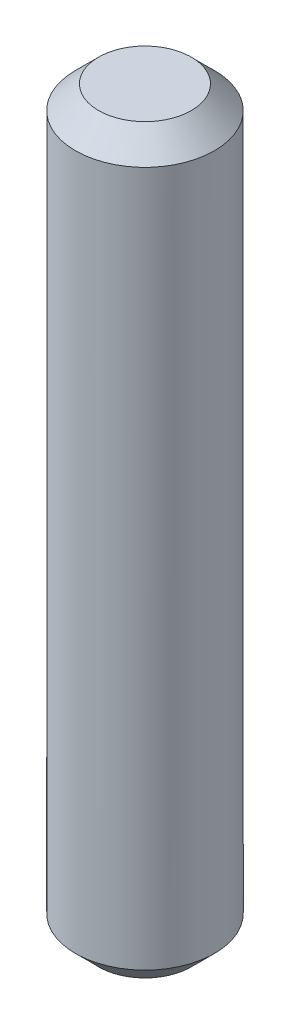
from build123d import *

# Parameters (mm, degrees)
SKETCH1_W     = 0.75
SKETCH1_H     = 8
CHAMFER1_SIZE = 0.25


with BuildPart() as part:
    # Sketch1 → Revolve1 (revolve)
    with BuildSketch(Plane.XY, mode=Mode.PRIVATE) as revolve1_sk:
        with Locations((0.375, 0)):
            Rectangle(SKETCH1_W, SKETCH1_H)
    revolve(revolve1_sk.sketch.rotate(Axis((0, 14.134029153, 0), (0, -1, 0)), 180), axis=Axis((0, 14.134029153, 0), (0, -1, 0)))

    # Chamfer1
    chamfer1_edges = [part.edges().sort_by_distance(p)[0] for p in [
        (0.75, 4, 0),
        (0.75, -4, 0),
    ]]
    chamfer(chamfer1_edges, length=CHAMFER1_SIZE)


solid = part.part
